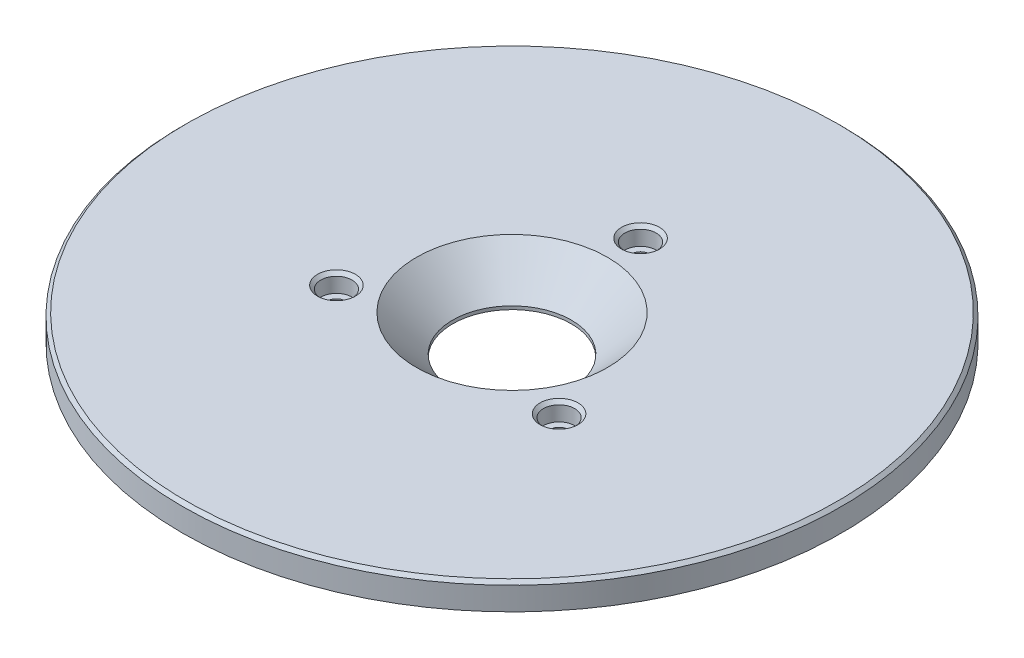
ISO-10303-21;
HEADER;
FILE_DESCRIPTION(('STEP AP214'),'2;1');
FILE_NAME('part.step','',(''),(''),'','','');
FILE_SCHEMA(('AUTOMOTIVE_DESIGN { 1 0 10303 214 1 1 1 1 }'));
ENDSEC;
DATA;
#1=APPLICATION_CONTEXT('core data for automotive mechanical design processes');
#2=APPLICATION_PROTOCOL_DEFINITION('international standard','automotive_design',2000,#1);
#3=PRODUCT_CONTEXT('',#1,'mechanical');
#4=PRODUCT('Part','Part','',(#3));
#5=PRODUCT_RELATED_PRODUCT_CATEGORY('part','',(#4));
#6=PRODUCT_DEFINITION_FORMATION('','',#4);
#7=PRODUCT_DEFINITION_CONTEXT('part definition',#1,'design');
#8=PRODUCT_DEFINITION('design','',#6,#7);
#9=PRODUCT_DEFINITION_SHAPE('','',#8);
#10=(LENGTH_UNIT() NAMED_UNIT(*) SI_UNIT(.MILLI.,.METRE.));
#11=(NAMED_UNIT(*) PLANE_ANGLE_UNIT() SI_UNIT($,.RADIAN.));
#12=(NAMED_UNIT(*) SI_UNIT($,.STERADIAN.) SOLID_ANGLE_UNIT());
#13=UNCERTAINTY_MEASURE_WITH_UNIT(LENGTH_MEASURE(1.E-05),#10,'distance_accuracy_value','');
#14=(GEOMETRIC_REPRESENTATION_CONTEXT(3) GLOBAL_UNCERTAINTY_ASSIGNED_CONTEXT((#13)) GLOBAL_UNIT_ASSIGNED_CONTEXT((#10,
#11,#12)) REPRESENTATION_CONTEXT('',''));
#15=CARTESIAN_POINT('',(0.,0.,0.));
#16=DIRECTION('',(0.,0.,1.));
#17=DIRECTION('',(1.,0.,0.));
#18=AXIS2_PLACEMENT_3D('',#15,#16,#17);
#19=CARTESIAN_POINT('',(-29.,12.,0.));
#20=DIRECTION('',(0.,-1.,0.));
#21=DIRECTION('',(0.,0.,-1.));
#22=AXIS2_PLACEMENT_3D('',#19,#20,#21);
#23=PLANE('',#22);
#24=CARTESIAN_POINT('',(33.7749907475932,12.,19.5));
#25=DIRECTION('',(0.,-1.,0.));
#26=DIRECTION('',(0.,0.,-1.));
#27=AXIS2_PLACEMENT_3D('',#24,#25,#26);
#28=CIRCLE('',#27,5.75);
#29=CARTESIAN_POINT('',(33.7749907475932,12.,13.75));
#30=VERTEX_POINT('',#29);
#31=EDGE_CURVE('E25',#30,#30,#28,.T.);
#32=ORIENTED_EDGE('',*,*,#31,.T.);
#33=EDGE_LOOP('',(#32));
#34=FACE_BOUND('',#33,.T.);
#35=CARTESIAN_POINT('',(0.,12.,-39.));
#36=DIRECTION('',(0.,-1.,0.));
#37=DIRECTION('',(0.,0.,-1.));
#38=AXIS2_PLACEMENT_3D('',#35,#36,#37);
#39=CIRCLE('',#38,5.74999999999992);
#40=CARTESIAN_POINT('',(0.,12.,-44.7499999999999));
#41=VERTEX_POINT('',#40);
#42=EDGE_CURVE('E29',#41,#41,#39,.T.);
#43=ORIENTED_EDGE('',*,*,#42,.T.);
#44=EDGE_LOOP('',(#43));
#45=FACE_BOUND('',#44,.T.);
#46=CARTESIAN_POINT('',(-33.7749907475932,12.,19.5));
#47=DIRECTION('',(0.,-1.,0.));
#48=DIRECTION('',(0.,0.,-1.));
#49=AXIS2_PLACEMENT_3D('',#46,#47,#48);
#50=CIRCLE('',#49,5.75);
#51=CARTESIAN_POINT('',(-33.7749907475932,12.,13.75));
#52=VERTEX_POINT('',#51);
#53=EDGE_CURVE('E34',#52,#52,#50,.T.);
#54=ORIENTED_EDGE('',*,*,#53,.T.);
#55=EDGE_LOOP('',(#54));
#56=FACE_BOUND('',#55,.T.);
#57=CARTESIAN_POINT('',(0.,12.,0.));
#58=DIRECTION('',(0.,-1.,0.));
#59=DIRECTION('',(0.,0.,-1.));
#60=AXIS2_PLACEMENT_3D('',#57,#58,#59);
#61=CIRCLE('',#60,99.);
#62=CARTESIAN_POINT('',(0.,12.,-99.));
#63=VERTEX_POINT('',#62);
#64=EDGE_CURVE('E58',#63,#63,#61,.F.);
#65=ORIENTED_EDGE('',*,*,#64,.T.);
#66=EDGE_LOOP('',(#65));
#67=FACE_BOUND('',#66,.T.);
#68=CARTESIAN_POINT('',(0.,12.,0.));
#69=DIRECTION('',(0.,-1.,0.));
#70=DIRECTION('',(0.,0.,-1.));
#71=AXIS2_PLACEMENT_3D('',#68,#69,#70);
#72=CIRCLE('',#71,29.);
#73=CARTESIAN_POINT('',(0.,12.,-29.));
#74=VERTEX_POINT('',#73);
#75=EDGE_CURVE('E70',#74,#74,#72,.T.);
#76=ORIENTED_EDGE('',*,*,#75,.T.);
#77=EDGE_LOOP('',(#76));
#78=FACE_BOUND('',#77,.T.);
#79=ADVANCED_FACE('F14',(#34,#45,#56,#67,#78),#23,.F.);
#80=CARTESIAN_POINT('',(0.,1.,0.));
#81=DIRECTION('',(0.,1.,0.));
#82=DIRECTION('',(0.,0.,1.));
#83=AXIS2_PLACEMENT_3D('',#80,#81,#82);
#84=CONICAL_SURFACE('',#83,18.,0.78539816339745);
#85=ORIENTED_EDGE('',*,*,#75,.F.);
#86=EDGE_LOOP('',(#85));
#87=FACE_BOUND('',#86,.T.);
#88=CARTESIAN_POINT('',(0.,1.,0.));
#89=DIRECTION('',(0.,-1.,0.));
#90=DIRECTION('',(0.,0.,-1.));
#91=AXIS2_PLACEMENT_3D('',#88,#89,#90);
#92=CIRCLE('',#91,18.);
#93=CARTESIAN_POINT('',(0.,1.,-18.));
#94=VERTEX_POINT('',#93);
#95=EDGE_CURVE('E83',#94,#94,#92,.T.);
#96=ORIENTED_EDGE('',*,*,#95,.T.);
#97=EDGE_LOOP('',(#96));
#98=FACE_BOUND('',#97,.T.);
#99=ADVANCED_FACE('F123',(#87,#98),#84,.F.);
#100=CARTESIAN_POINT('',(0.,0.,0.));
#101=DIRECTION('',(0.,-1.,0.));
#102=DIRECTION('',(0.,0.,-1.));
#103=AXIS2_PLACEMENT_3D('',#100,#101,#102);
#104=CYLINDRICAL_SURFACE('',#103,18.);
#105=ORIENTED_EDGE('',*,*,#95,.F.);
#106=EDGE_LOOP('',(#105));
#107=FACE_BOUND('',#106,.T.);
#108=CARTESIAN_POINT('',(0.,0.,0.));
#109=DIRECTION('',(0.,-1.,0.));
#110=DIRECTION('',(0.,0.,-1.));
#111=AXIS2_PLACEMENT_3D('',#108,#109,#110);
#112=CIRCLE('',#111,18.);
#113=CARTESIAN_POINT('',(0.,0.,-18.));
#114=VERTEX_POINT('',#113);
#115=EDGE_CURVE('E86',#114,#114,#112,.T.);
#116=ORIENTED_EDGE('',*,*,#115,.T.);
#117=EDGE_LOOP('',(#116));
#118=FACE_BOUND('',#117,.T.);
#119=ADVANCED_FACE('F130',(#107,#118),#104,.F.);
#120=CARTESIAN_POINT('',(-18.,0.,0.));
#121=DIRECTION('',(0.,1.,0.));
#122=DIRECTION('',(0.,0.,1.));
#123=AXIS2_PLACEMENT_3D('',#120,#121,#122);
#124=PLANE('',#123);
#125=CARTESIAN_POINT('',(-33.7749907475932,0.,19.5));
#126=DIRECTION('',(0.,1.,0.));
#127=DIRECTION('',(0.,0.,1.));
#128=AXIS2_PLACEMENT_3D('',#125,#126,#127);
#129=CIRCLE('',#128,3.74999999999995);
#130=CARTESIAN_POINT('',(-33.7749907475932,0.,23.25));
#131=VERTEX_POINT('',#130);
#132=EDGE_CURVE('E49',#131,#131,#129,.T.);
#133=ORIENTED_EDGE('',*,*,#132,.T.);
#134=EDGE_LOOP('',(#133));
#135=FACE_BOUND('',#134,.T.);
#136=CARTESIAN_POINT('',(33.7749907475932,0.,19.5));
#137=DIRECTION('',(0.,1.,0.));
#138=DIRECTION('',(0.,0.,1.));
#139=AXIS2_PLACEMENT_3D('',#136,#137,#138);
#140=CIRCLE('',#139,3.74999999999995);
#141=CARTESIAN_POINT('',(33.7749907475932,0.,23.25));
#142=VERTEX_POINT('',#141);
#143=EDGE_CURVE('E52',#142,#142,#140,.T.);
#144=ORIENTED_EDGE('',*,*,#143,.T.);
#145=EDGE_LOOP('',(#144));
#146=FACE_BOUND('',#145,.T.);
#147=CARTESIAN_POINT('',(0.,0.,-39.));
#148=DIRECTION('',(0.,1.,0.));
#149=DIRECTION('',(0.,0.,1.));
#150=AXIS2_PLACEMENT_3D('',#147,#148,#149);
#151=CIRCLE('',#150,3.75);
#152=CARTESIAN_POINT('',(0.,0.,-35.25));
#153=VERTEX_POINT('',#152);
#154=EDGE_CURVE('E55',#153,#153,#151,.T.);
#155=ORIENTED_EDGE('',*,*,#154,.T.);
#156=EDGE_LOOP('',(#155));
#157=FACE_BOUND('',#156,.T.);
#158=CARTESIAN_POINT('',(0.,0.,0.));
#159=DIRECTION('',(0.,1.,0.));
#160=DIRECTION('',(0.,0.,1.));
#161=AXIS2_PLACEMENT_3D('',#158,#159,#160);
#162=CIRCLE('',#161,44.);
#163=CARTESIAN_POINT('',(0.,0.,44.));
#164=VERTEX_POINT('',#163);
#165=EDGE_CURVE('E67',#164,#164,#162,.F.);
#166=ORIENTED_EDGE('',*,*,#165,.T.);
#167=EDGE_LOOP('',(#166));
#168=FACE_BOUND('',#167,.T.);
#169=ORIENTED_EDGE('',*,*,#115,.F.);
#170=EDGE_LOOP('',(#169));
#171=FACE_BOUND('',#170,.T.);
#172=ADVANCED_FACE('F181',(#135,#146,#157,#168,#171),#124,.F.);
#173=CARTESIAN_POINT('',(0.,0.,0.));
#174=DIRECTION('',(0.,-1.,0.));
#175=DIRECTION('',(0.,0.,-1.));
#176=AXIS2_PLACEMENT_3D('',#173,#174,#175);
#177=CYLINDRICAL_SURFACE('',#176,45.);
#178=CARTESIAN_POINT('',(0.,0.999999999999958,0.));
#179=DIRECTION('',(0.,1.,0.));
#180=DIRECTION('',(0.,0.,1.));
#181=AXIS2_PLACEMENT_3D('',#178,#179,#180);
#182=CIRCLE('',#181,45.);
#183=CARTESIAN_POINT('',(0.,0.999999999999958,45.));
#184=VERTEX_POINT('',#183);
#185=EDGE_CURVE('E64',#184,#184,#182,.T.);
#186=ORIENTED_EDGE('',*,*,#185,.T.);
#187=EDGE_LOOP('',(#186));
#188=FACE_BOUND('',#187,.T.);
#189=CARTESIAN_POINT('',(0.,4.,0.));
#190=DIRECTION('',(0.,-1.,0.));
#191=DIRECTION('',(0.,0.,-1.));
#192=AXIS2_PLACEMENT_3D('',#189,#190,#191);
#193=CIRCLE('',#192,45.);
#194=CARTESIAN_POINT('',(0.,4.,-45.));
#195=VERTEX_POINT('',#194);
#196=EDGE_CURVE('E89',#195,#195,#193,.T.);
#197=ORIENTED_EDGE('',*,*,#196,.T.);
#198=EDGE_LOOP('',(#197));
#199=FACE_BOUND('',#198,.T.);
#200=ADVANCED_FACE('F185',(#188,#199),#177,.T.);
#201=CARTESIAN_POINT('',(-45.,4.,0.));
#202=DIRECTION('',(0.,1.,0.));
#203=DIRECTION('',(0.,0.,1.));
#204=AXIS2_PLACEMENT_3D('',#201,#202,#203);
#205=PLANE('',#204);
#206=ORIENTED_EDGE('',*,*,#196,.F.);
#207=EDGE_LOOP('',(#206));
#208=FACE_BOUND('',#207,.T.);
#209=CARTESIAN_POINT('',(0.,4.,0.));
#210=DIRECTION('',(0.,-1.,0.));
#211=DIRECTION('',(0.,0.,-1.));
#212=AXIS2_PLACEMENT_3D('',#209,#210,#211);
#213=CIRCLE('',#212,100.);
#214=CARTESIAN_POINT('',(0.,4.,-100.));
#215=VERTEX_POINT('',#214);
#216=EDGE_CURVE('E92',#215,#215,#213,.T.);
#217=ORIENTED_EDGE('',*,*,#216,.T.);
#218=EDGE_LOOP('',(#217));
#219=FACE_BOUND('',#218,.T.);
#220=ADVANCED_FACE('F192',(#208,#219),#205,.F.);
#221=CARTESIAN_POINT('',(0.,0.,0.));
#222=DIRECTION('',(0.,-1.,0.));
#223=DIRECTION('',(0.,0.,-1.));
#224=AXIS2_PLACEMENT_3D('',#221,#222,#223);
#225=CYLINDRICAL_SURFACE('',#224,100.);
#226=CARTESIAN_POINT('',(0.,11.,0.));
#227=DIRECTION('',(0.,-1.,0.));
#228=DIRECTION('',(0.,0.,-1.));
#229=AXIS2_PLACEMENT_3D('',#226,#227,#228);
#230=CIRCLE('',#229,100.);
#231=CARTESIAN_POINT('',(0.,11.,-100.));
#232=VERTEX_POINT('',#231);
#233=EDGE_CURVE('E61',#232,#232,#230,.T.);
#234=ORIENTED_EDGE('',*,*,#233,.T.);
#235=EDGE_LOOP('',(#234));
#236=FACE_BOUND('',#235,.T.);
#237=ORIENTED_EDGE('',*,*,#216,.F.);
#238=EDGE_LOOP('',(#237));
#239=FACE_BOUND('',#238,.T.);
#240=ADVANCED_FACE('F199',(#236,#239),#225,.T.);
#241=CARTESIAN_POINT('',(33.7749907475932,6.5,19.5));
#242=DIRECTION('',(0.,1.,0.));
#243=DIRECTION('',(0.,0.,1.));
#244=AXIS2_PLACEMENT_3D('',#241,#242,#243);
#245=CYLINDRICAL_SURFACE('',#244,4.75);
#246=CARTESIAN_POINT('',(33.7749907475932,11.,19.5));
#247=DIRECTION('',(0.,-1.,0.));
#248=DIRECTION('',(0.,0.,-1.));
#249=AXIS2_PLACEMENT_3D('',#246,#247,#248);
#250=CIRCLE('',#249,4.75);
#251=CARTESIAN_POINT('',(33.7749907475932,11.,14.75));
#252=VERTEX_POINT('',#251);
#253=EDGE_CURVE('E37',#252,#252,#250,.F.);
#254=ORIENTED_EDGE('',*,*,#253,.T.);
#255=EDGE_LOOP('',(#254));
#256=FACE_BOUND('',#255,.T.);
#257=CARTESIAN_POINT('',(33.7749907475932,6.5,19.5));
#258=DIRECTION('',(0.,1.,0.));
#259=DIRECTION('',(0.,0.,-1.));
#260=AXIS2_PLACEMENT_3D('',#257,#258,#259);
#261=CIRCLE('',#260,4.75);
#262=CARTESIAN_POINT('',(33.7749907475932,6.5,14.75));
#263=VERTEX_POINT('',#262);
#264=EDGE_CURVE('E74',#263,#263,#261,.T.);
#265=ORIENTED_EDGE('',*,*,#264,.F.);
#266=EDGE_LOOP('',(#265));
#267=FACE_BOUND('',#266,.T.);
#268=ADVANCED_FACE('F203',(#256,#267),#245,.F.);
#269=CARTESIAN_POINT('',(33.7749907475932,6.5,19.5));
#270=DIRECTION('',(0.,-1.,0.));
#271=DIRECTION('',(0.,0.,-1.));
#272=AXIS2_PLACEMENT_3D('',#269,#270,#271);
#273=PLANE('',#272);
#274=CARTESIAN_POINT('',(33.7749907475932,6.5,19.5));
#275=DIRECTION('',(0.,-1.,0.));
#276=DIRECTION('',(0.,0.,-1.));
#277=AXIS2_PLACEMENT_3D('',#274,#275,#276);
#278=CIRCLE('',#277,2.75);
#279=CARTESIAN_POINT('',(33.7749907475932,6.5,16.75));
#280=VERTEX_POINT('',#279);
#281=EDGE_CURVE('E71',#280,#280,#278,.T.);
#282=ORIENTED_EDGE('',*,*,#281,.T.);
#283=EDGE_LOOP('',(#282));
#284=FACE_BOUND('',#283,.T.);
#285=ORIENTED_EDGE('',*,*,#264,.T.);
#286=EDGE_LOOP('',(#285));
#287=FACE_BOUND('',#286,.T.);
#288=ADVANCED_FACE('F207',(#284,#287),#273,.F.);
#289=CARTESIAN_POINT('',(-33.7749907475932,6.5,19.5));
#290=DIRECTION('',(0.,1.,0.));
#291=DIRECTION('',(0.,0.,1.));
#292=AXIS2_PLACEMENT_3D('',#289,#290,#291);
#293=CYLINDRICAL_SURFACE('',#292,4.75);
#294=CARTESIAN_POINT('',(-33.7749907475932,11.,19.5));
#295=DIRECTION('',(0.,-1.,0.));
#296=DIRECTION('',(0.,0.,-1.));
#297=AXIS2_PLACEMENT_3D('',#294,#295,#296);
#298=CIRCLE('',#297,4.75);
#299=CARTESIAN_POINT('',(-33.7749907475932,11.,14.75));
#300=VERTEX_POINT('',#299);
#301=EDGE_CURVE('E9',#300,#300,#298,.F.);
#302=ORIENTED_EDGE('',*,*,#301,.T.);
#303=EDGE_LOOP('',(#302));
#304=FACE_BOUND('',#303,.T.);
#305=CARTESIAN_POINT('',(-33.7749907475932,6.5,19.5));
#306=DIRECTION('',(0.,1.,0.));
#307=DIRECTION('',(0.,0.,1.));
#308=AXIS2_PLACEMENT_3D('',#305,#306,#307);
#309=CIRCLE('',#308,4.75);
#310=CARTESIAN_POINT('',(-33.7749907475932,6.5,24.25));
#311=VERTEX_POINT('',#310);
#312=EDGE_CURVE('E98',#311,#311,#309,.T.);
#313=ORIENTED_EDGE('',*,*,#312,.F.);
#314=EDGE_LOOP('',(#313));
#315=FACE_BOUND('',#314,.T.);
#316=ADVANCED_FACE('F119',(#304,#315),#293,.F.);
#317=CARTESIAN_POINT('',(-33.7749907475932,6.5,19.5));
#318=DIRECTION('',(0.,1.,0.));
#319=DIRECTION('',(0.,0.,1.));
#320=AXIS2_PLACEMENT_3D('',#317,#318,#319);
#321=PLANE('',#320);
#322=CARTESIAN_POINT('',(-33.7749907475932,6.5,19.5));
#323=DIRECTION('',(0.,1.,0.));
#324=DIRECTION('',(0.,0.,1.));
#325=AXIS2_PLACEMENT_3D('',#322,#323,#324);
#326=CIRCLE('',#325,2.75);
#327=CARTESIAN_POINT('',(-33.7749907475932,6.5,22.25));
#328=VERTEX_POINT('',#327);
#329=EDGE_CURVE('E75',#328,#328,#326,.T.);
#330=ORIENTED_EDGE('',*,*,#329,.F.);
#331=EDGE_LOOP('',(#330));
#332=FACE_BOUND('',#331,.T.);
#333=ORIENTED_EDGE('',*,*,#312,.T.);
#334=EDGE_LOOP('',(#333));
#335=FACE_BOUND('',#334,.T.);
#336=ADVANCED_FACE('F108',(#332,#335),#321,.T.);
#337=CARTESIAN_POINT('',(0.,6.5,-39.));
#338=DIRECTION('',(0.,1.,0.));
#339=DIRECTION('',(0.,0.,1.));
#340=AXIS2_PLACEMENT_3D('',#337,#338,#339);
#341=CYLINDRICAL_SURFACE('',#340,4.75);
#342=CARTESIAN_POINT('',(0.,11.,-39.));
#343=DIRECTION('',(0.,-1.,0.));
#344=DIRECTION('',(0.,0.,-1.));
#345=AXIS2_PLACEMENT_3D('',#342,#343,#344);
#346=CIRCLE('',#345,4.75);
#347=CARTESIAN_POINT('',(0.,11.,-43.75));
#348=VERTEX_POINT('',#347);
#349=EDGE_CURVE('E21',#348,#348,#346,.F.);
#350=ORIENTED_EDGE('',*,*,#349,.T.);
#351=EDGE_LOOP('',(#350));
#352=FACE_BOUND('',#351,.T.);
#353=CARTESIAN_POINT('',(0.,6.5,-39.));
#354=DIRECTION('',(0.,1.,0.));
#355=DIRECTION('',(0.,0.,1.));
#356=AXIS2_PLACEMENT_3D('',#353,#354,#355);
#357=CIRCLE('',#356,4.75);
#358=CARTESIAN_POINT('',(0.,6.5,-34.25));
#359=VERTEX_POINT('',#358);
#360=EDGE_CURVE('E95',#359,#359,#357,.T.);
#361=ORIENTED_EDGE('',*,*,#360,.F.);
#362=EDGE_LOOP('',(#361));
#363=FACE_BOUND('',#362,.T.);
#364=ADVANCED_FACE('F106',(#352,#363),#341,.F.);
#365=CARTESIAN_POINT('',(0.,6.5,-39.));
#366=DIRECTION('',(0.,1.,0.));
#367=DIRECTION('',(0.,0.,1.));
#368=AXIS2_PLACEMENT_3D('',#365,#366,#367);
#369=PLANE('',#368);
#370=CARTESIAN_POINT('',(0.,6.5,-39.));
#371=DIRECTION('',(0.,1.,0.));
#372=DIRECTION('',(0.,0.,1.));
#373=AXIS2_PLACEMENT_3D('',#370,#371,#372);
#374=CIRCLE('',#373,2.75);
#375=CARTESIAN_POINT('',(0.,6.5,-36.25));
#376=VERTEX_POINT('',#375);
#377=EDGE_CURVE('E78',#376,#376,#374,.T.);
#378=ORIENTED_EDGE('',*,*,#377,.F.);
#379=EDGE_LOOP('',(#378));
#380=FACE_BOUND('',#379,.T.);
#381=ORIENTED_EDGE('',*,*,#360,.T.);
#382=EDGE_LOOP('',(#381));
#383=FACE_BOUND('',#382,.T.);
#384=ADVANCED_FACE('F104',(#380,#383),#369,.T.);
#385=CARTESIAN_POINT('',(0.,0.,-39.));
#386=DIRECTION('',(0.,1.,0.));
#387=DIRECTION('',(0.,0.,1.));
#388=AXIS2_PLACEMENT_3D('',#385,#386,#387);
#389=CYLINDRICAL_SURFACE('',#388,2.75);
#390=CARTESIAN_POINT('',(0.,1.00000000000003,-39.));
#391=DIRECTION('',(0.,1.,0.));
#392=DIRECTION('',(0.,0.,1.));
#393=AXIS2_PLACEMENT_3D('',#390,#391,#392);
#394=CIRCLE('',#393,2.75);
#395=CARTESIAN_POINT('',(0.,1.00000000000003,-36.25));
#396=VERTEX_POINT('',#395);
#397=EDGE_CURVE('E40',#396,#396,#394,.F.);
#398=ORIENTED_EDGE('',*,*,#397,.T.);
#399=EDGE_LOOP('',(#398));
#400=FACE_BOUND('',#399,.T.);
#401=ORIENTED_EDGE('',*,*,#377,.T.);
#402=EDGE_LOOP('',(#401));
#403=FACE_BOUND('',#402,.T.);
#404=ADVANCED_FACE('F116',(#400,#403),#389,.F.);
#405=CARTESIAN_POINT('',(-33.7749907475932,0.,19.5));
#406=DIRECTION('',(0.,1.,0.));
#407=DIRECTION('',(0.,0.,1.));
#408=AXIS2_PLACEMENT_3D('',#405,#406,#407);
#409=CYLINDRICAL_SURFACE('',#408,2.75);
#410=CARTESIAN_POINT('',(-33.7749907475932,0.999999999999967,19.5));
#411=DIRECTION('',(0.,1.,0.));
#412=DIRECTION('',(0.,0.,1.));
#413=AXIS2_PLACEMENT_3D('',#410,#411,#412);
#414=CIRCLE('',#413,2.75);
#415=CARTESIAN_POINT('',(-33.7749907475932,0.999999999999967,22.25));
#416=VERTEX_POINT('',#415);
#417=EDGE_CURVE('E46',#416,#416,#414,.F.);
#418=ORIENTED_EDGE('',*,*,#417,.T.);
#419=EDGE_LOOP('',(#418));
#420=FACE_BOUND('',#419,.T.);
#421=ORIENTED_EDGE('',*,*,#329,.T.);
#422=EDGE_LOOP('',(#421));
#423=FACE_BOUND('',#422,.T.);
#424=ADVANCED_FACE('F338',(#420,#423),#409,.F.);
#425=CARTESIAN_POINT('',(33.7749907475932,0.,19.5));
#426=DIRECTION('',(0.,1.,0.));
#427=DIRECTION('',(0.,0.,1.));
#428=AXIS2_PLACEMENT_3D('',#425,#426,#427);
#429=CYLINDRICAL_SURFACE('',#428,2.75);
#430=CARTESIAN_POINT('',(33.7749907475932,0.999999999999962,19.5));
#431=DIRECTION('',(0.,1.,0.));
#432=DIRECTION('',(0.,0.,1.));
#433=AXIS2_PLACEMENT_3D('',#430,#431,#432);
#434=CIRCLE('',#433,2.75);
#435=CARTESIAN_POINT('',(33.7749907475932,0.999999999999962,22.25));
#436=VERTEX_POINT('',#435);
#437=EDGE_CURVE('E43',#436,#436,#434,.F.);
#438=ORIENTED_EDGE('',*,*,#437,.T.);
#439=EDGE_LOOP('',(#438));
#440=FACE_BOUND('',#439,.T.);
#441=ORIENTED_EDGE('',*,*,#281,.F.);
#442=EDGE_LOOP('',(#441));
#443=FACE_BOUND('',#442,.T.);
#444=ADVANCED_FACE('F140',(#440,#443),#429,.F.);
#445=CARTESIAN_POINT('',(0.,0.,0.));
#446=DIRECTION('',(0.,1.,0.));
#447=DIRECTION('',(0.,0.,1.));
#448=AXIS2_PLACEMENT_3D('',#445,#446,#447);
#449=CONICAL_SURFACE('',#448,44.,0.785398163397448);
#450=ORIENTED_EDGE('',*,*,#185,.F.);
#451=EDGE_LOOP('',(#450));
#452=FACE_BOUND('',#451,.T.);
#453=ORIENTED_EDGE('',*,*,#165,.F.);
#454=EDGE_LOOP('',(#453));
#455=FACE_BOUND('',#454,.T.);
#456=ADVANCED_FACE('F136',(#452,#455),#449,.T.);
#457=CARTESIAN_POINT('',(0.,11.,0.));
#458=DIRECTION('',(0.,-1.,0.));
#459=DIRECTION('',(0.,0.,-1.));
#460=AXIS2_PLACEMENT_3D('',#457,#458,#459);
#461=CONICAL_SURFACE('',#460,100.,0.785398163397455);
#462=ORIENTED_EDGE('',*,*,#64,.F.);
#463=EDGE_LOOP('',(#462));
#464=FACE_BOUND('',#463,.T.);
#465=ORIENTED_EDGE('',*,*,#233,.F.);
#466=EDGE_LOOP('',(#465));
#467=FACE_BOUND('',#466,.T.);
#468=ADVANCED_FACE('F139',(#464,#467),#461,.T.);
#469=CARTESIAN_POINT('',(-33.7749907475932,0.,19.5));
#470=DIRECTION('',(0.,-1.,0.));
#471=DIRECTION('',(0.,0.,-1.));
#472=AXIS2_PLACEMENT_3D('',#469,#470,#471);
#473=CONICAL_SURFACE('',#472,3.74999999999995,0.785398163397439);
#474=ORIENTED_EDGE('',*,*,#417,.F.);
#475=EDGE_LOOP('',(#474));
#476=FACE_BOUND('',#475,.T.);
#477=ORIENTED_EDGE('',*,*,#132,.F.);
#478=EDGE_LOOP('',(#477));
#479=FACE_BOUND('',#478,.T.);
#480=ADVANCED_FACE('F144',(#476,#479),#473,.F.);
#481=CARTESIAN_POINT('',(33.7749907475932,0.,19.5));
#482=DIRECTION('',(0.,-1.,0.));
#483=DIRECTION('',(0.,0.,-1.));
#484=AXIS2_PLACEMENT_3D('',#481,#482,#483);
#485=CONICAL_SURFACE('',#484,3.74999999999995,0.785398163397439);
#486=ORIENTED_EDGE('',*,*,#437,.F.);
#487=EDGE_LOOP('',(#486));
#488=FACE_BOUND('',#487,.T.);
#489=ORIENTED_EDGE('',*,*,#143,.F.);
#490=EDGE_LOOP('',(#489));
#491=FACE_BOUND('',#490,.T.);
#492=ADVANCED_FACE('F148',(#488,#491),#485,.F.);
#493=CARTESIAN_POINT('',(0.,0.,-39.));
#494=DIRECTION('',(0.,-1.,0.));
#495=DIRECTION('',(0.,0.,-1.));
#496=AXIS2_PLACEMENT_3D('',#493,#494,#495);
#497=CONICAL_SURFACE('',#496,3.75,0.785398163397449);
#498=ORIENTED_EDGE('',*,*,#397,.F.);
#499=EDGE_LOOP('',(#498));
#500=FACE_BOUND('',#499,.T.);
#501=ORIENTED_EDGE('',*,*,#154,.F.);
#502=EDGE_LOOP('',(#501));
#503=FACE_BOUND('',#502,.T.);
#504=ADVANCED_FACE('F152',(#500,#503),#497,.F.);
#505=CARTESIAN_POINT('',(33.7749907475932,11.,19.5));
#506=DIRECTION('',(0.,1.,0.));
#507=DIRECTION('',(0.,0.,1.));
#508=AXIS2_PLACEMENT_3D('',#505,#506,#507);
#509=CONICAL_SURFACE('',#508,4.75,0.785398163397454);
#510=ORIENTED_EDGE('',*,*,#31,.F.);
#511=EDGE_LOOP('',(#510));
#512=FACE_BOUND('',#511,.T.);
#513=ORIENTED_EDGE('',*,*,#253,.F.);
#514=EDGE_LOOP('',(#513));
#515=FACE_BOUND('',#514,.T.);
#516=ADVANCED_FACE('F156',(#512,#515),#509,.F.);
#517=CARTESIAN_POINT('',(0.,11.,-39.));
#518=DIRECTION('',(0.,1.,0.));
#519=DIRECTION('',(0.,0.,1.));
#520=AXIS2_PLACEMENT_3D('',#517,#518,#519);
#521=CONICAL_SURFACE('',#520,4.75,0.785398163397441);
#522=ORIENTED_EDGE('',*,*,#42,.F.);
#523=EDGE_LOOP('',(#522));
#524=FACE_BOUND('',#523,.T.);
#525=ORIENTED_EDGE('',*,*,#349,.F.);
#526=EDGE_LOOP('',(#525));
#527=FACE_BOUND('',#526,.T.);
#528=ADVANCED_FACE('F159',(#524,#527),#521,.F.);
#529=CARTESIAN_POINT('',(-33.7749907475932,11.,19.5));
#530=DIRECTION('',(0.,1.,0.));
#531=DIRECTION('',(0.,0.,1.));
#532=AXIS2_PLACEMENT_3D('',#529,#530,#531);
#533=CONICAL_SURFACE('',#532,4.75,0.785398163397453);
#534=ORIENTED_EDGE('',*,*,#53,.F.);
#535=EDGE_LOOP('',(#534));
#536=FACE_BOUND('',#535,.T.);
#537=ORIENTED_EDGE('',*,*,#301,.F.);
#538=EDGE_LOOP('',(#537));
#539=FACE_BOUND('',#538,.T.);
#540=ADVANCED_FACE('F16',(#536,#539),#533,.F.);
#541=CLOSED_SHELL('',(#79,#99,#119,#172,#200,#220,#240,#268,#288,#316,#336,#364,#384,#404,#424,
#444,#456,#468,#480,#492,#504,#516,#528,#540));
#542=MANIFOLD_SOLID_BREP('B1',#541);
#543=ADVANCED_BREP_SHAPE_REPRESENTATION('',(#18,#542),#14);
#544=SHAPE_DEFINITION_REPRESENTATION(#9,#543);
ENDSEC;
END-ISO-10303-21;
